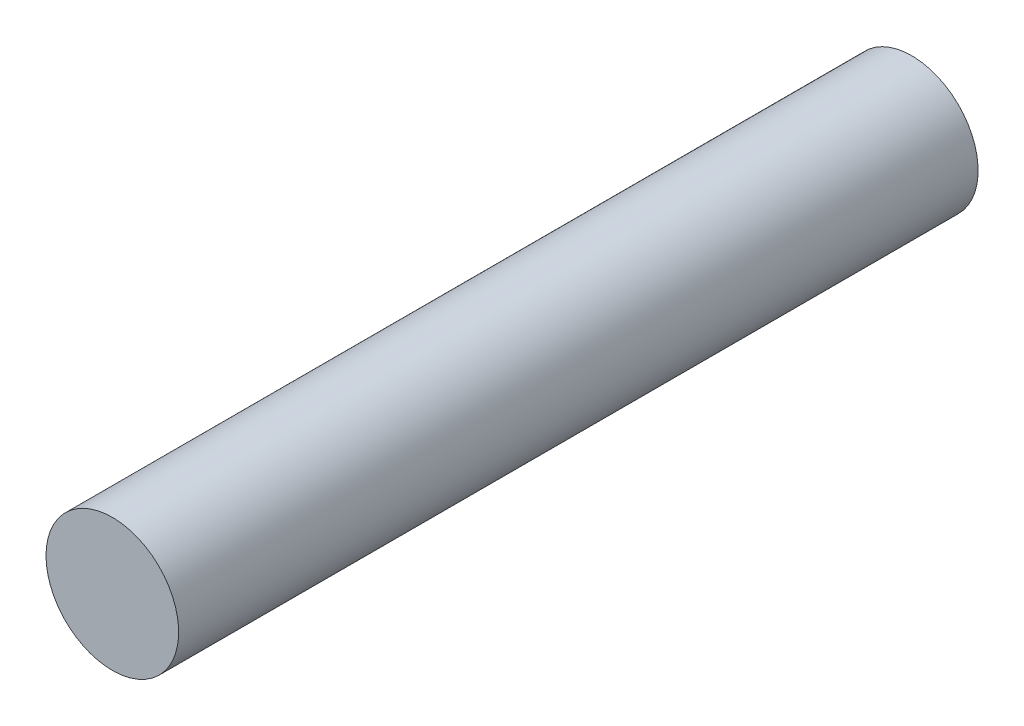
from build123d import *

# Parameters (mm, degrees)
SKETCH1_R           = 38
BOSS_EXTRUDE1_DEPTH = 229


with BuildPart() as part:
    # Sketch1 → Boss-Extrude1 (new, symmetric)
    with BuildSketch(Plane.XY):
        with Locations(Location((0, 0, 0), (0, 0, 180))):
            Circle(SKETCH1_R)
    extrude(amount=BOSS_EXTRUDE1_DEPTH, both=True)


solid = part.part
